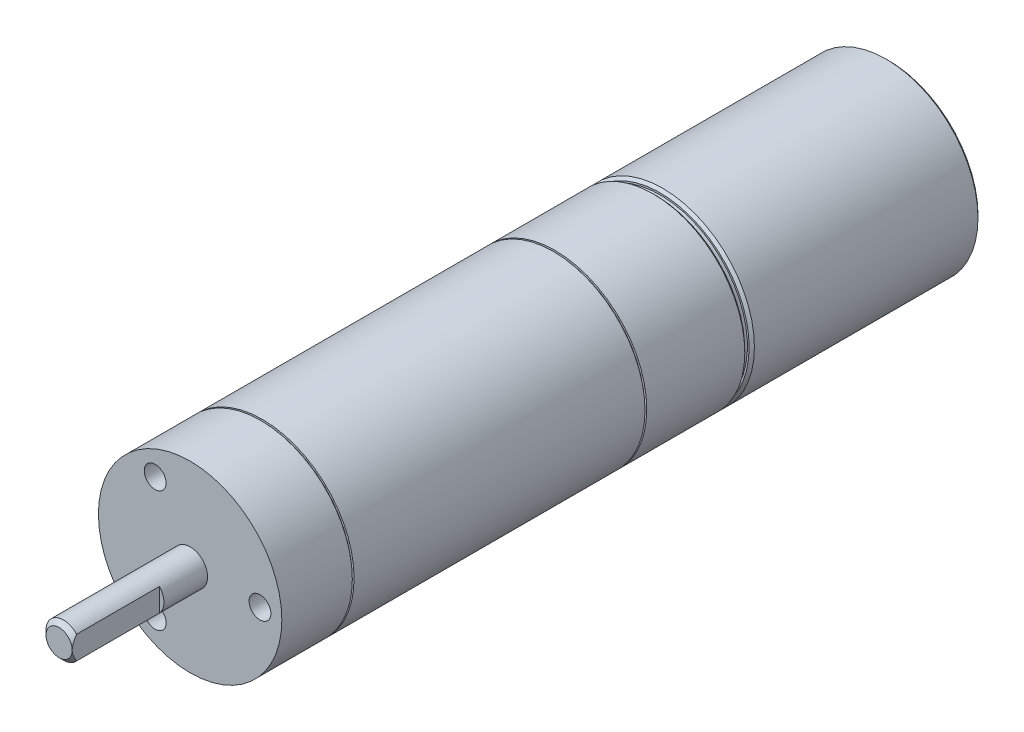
from build123d import *

# Parameters (mm, degrees)
ESQUISSE1_R             = 10.5
BOSS_EXTRU_1_DEPTH      = 80
ESQUISSE2_R             = 2
BOSS_EXTRU_2_DEPTH      = 15
CHANFREIN1_SIZE         = 0.5
ESQUISSE3_R             = 1.25
ENL_V_MAT_EXTRU_1_DEPTH = 5
ESQUISSE4_W             = 1.230691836
ESQUISSE4_H             = 0.2
ESQUISSE4_W_2           = 0.615345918
ESQUISSE4_H_2           = 0.5
CHANFREIN2_SIZE         = 0.3
ESQUISSE5_W             = 2.656704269
ESQUISSE5_H             = 5.154799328
ENL_V_MAT_EXTRU_2_DEPTH = 10


with BuildPart() as part:
    # Esquisse1 → Boss.-Extru.1 (new body)
    with BuildSketch(Plane.XY):
        Circle(ESQUISSE1_R)
    extrude(amount=BOSS_EXTRU_1_DEPTH)

    # Esquisse2 → Boss.-Extru.2 (add)
    with BuildSketch(Plane.XY.offset(80)):
        Circle(ESQUISSE2_R)
    extrude(amount=BOSS_EXTRU_2_DEPTH)

    # Chanfrein1
    chanfrein1_edges = [part.edges().sort_by_distance(p)[0] for p in [
        (-2, 0, 95),
    ]]
    chamfer(chanfrein1_edges, length=CHANFREIN1_SIZE)

    # Esquisse3 → Enl_v. mat.-Extru.1 (cut)
    with BuildSketch(Plane.XY.offset(80)):
        with Locations((-4, 6.92820323)):
            Circle(ESQUISSE3_R)
        with Locations((8, 0)):
            Circle(ESQUISSE3_R)
        with Locations((-4, -6.92820323)):
            Circle(ESQUISSE3_R)
    extrude(amount=-ENL_V_MAT_EXTRU_1_DEPTH, mode=Mode.SUBTRACT)

    # Esquisse4 → Enl_vement de mati_re-R_volution1 (revolve, cut)
    with BuildSketch(Plane(origin=(0, 0, 0), x_dir=(1, 0, 0), z_dir=(0, 1, 0)), mode=Mode.PRIVATE) as enl_vement_de_mati_re_r_volution1_sk:
        with Locations((10.891583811, -71.828394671)):
            Rectangle(ESQUISSE4_W, ESQUISSE4_H)
        with Locations((10.891583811, -38.321507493)):
            Rectangle(ESQUISSE4_W, ESQUISSE4_H)
        with Locations((10.307672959, -26.44777848)):
            Rectangle(ESQUISSE4_W_2, ESQUISSE4_H_2)
    revolve(enl_vement_de_mati_re_r_volution1_sk.sketch.rotate(Axis((0, 0, -6.641145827), (0, 0, 1)), 180), axis=Axis((0, 0, -6.641145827), (0, 0, 1)), mode=Mode.SUBTRACT)

    # Chanfrein2
    chanfrein2_edges = [part.edges().sort_by_distance(p)[0] for p in [
        (-10.5, 0, 0),
        (-10.5, 0, 26.69777848),
        (-10.5, 0, 26.19777848),
    ]]
    chamfer(chanfrein2_edges, length=CHANFREIN2_SIZE)

    # Esquisse5 → Enl_v. mat.-Extru.2 (cut)
    with BuildSketch(Plane.XY.offset(95)):
        with Locations((2.828352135, 0.257739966)):
            Rectangle(ESQUISSE5_W, ESQUISSE5_H)
    extrude(amount=-ENL_V_MAT_EXTRU_2_DEPTH, mode=Mode.SUBTRACT)


solid = part.part
